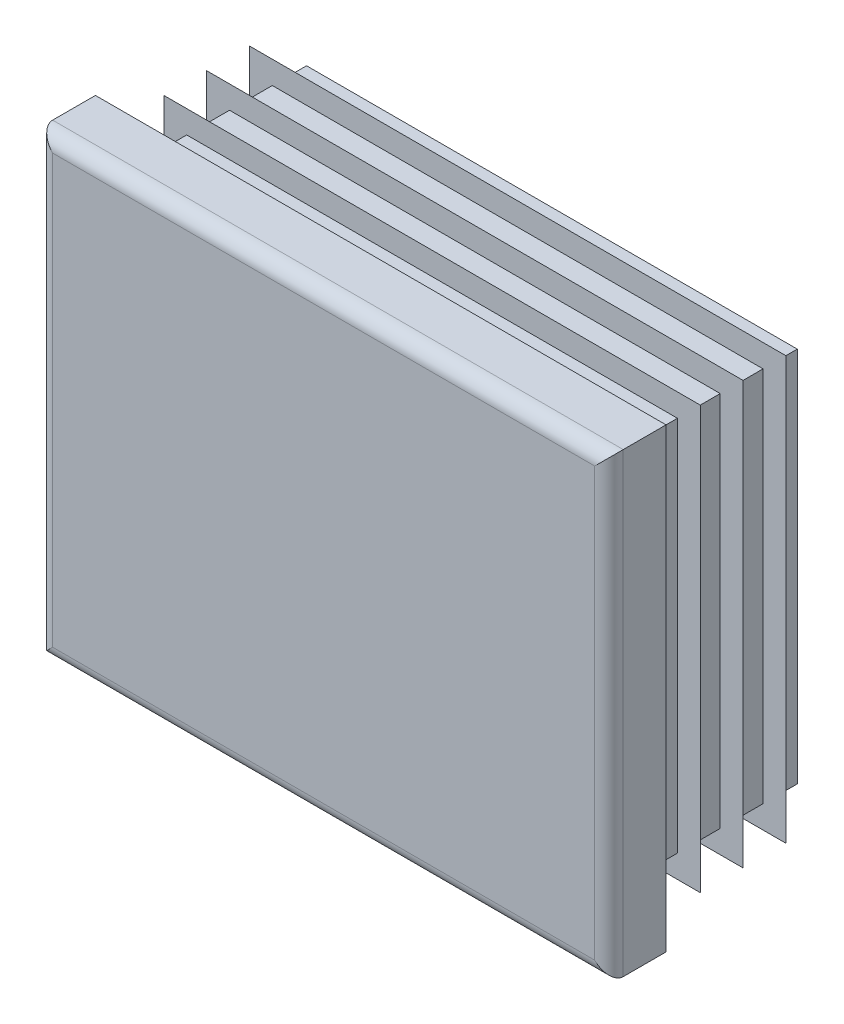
ISO-10303-21;
HEADER;
FILE_DESCRIPTION(('STEP AP214'),'2;1');
FILE_NAME('part.step','',(''),(''),'','','');
FILE_SCHEMA(('AUTOMOTIVE_DESIGN { 1 0 10303 214 1 1 1 1 }'));
ENDSEC;
DATA;
#1=APPLICATION_CONTEXT('core data for automotive mechanical design processes');
#2=APPLICATION_PROTOCOL_DEFINITION('international standard','automotive_design',2000,#1);
#3=PRODUCT_CONTEXT('',#1,'mechanical');
#4=PRODUCT('Part','Part','',(#3));
#5=PRODUCT_RELATED_PRODUCT_CATEGORY('part','',(#4));
#6=PRODUCT_DEFINITION_FORMATION('','',#4);
#7=PRODUCT_DEFINITION_CONTEXT('part definition',#1,'design');
#8=PRODUCT_DEFINITION('design','',#6,#7);
#9=PRODUCT_DEFINITION_SHAPE('','',#8);
#10=(LENGTH_UNIT() NAMED_UNIT(*) SI_UNIT(.MILLI.,.METRE.));
#11=(NAMED_UNIT(*) PLANE_ANGLE_UNIT() SI_UNIT($,.RADIAN.));
#12=(NAMED_UNIT(*) SI_UNIT($,.STERADIAN.) SOLID_ANGLE_UNIT());
#13=UNCERTAINTY_MEASURE_WITH_UNIT(LENGTH_MEASURE(1.E-05),#10,'distance_accuracy_value','');
#14=(GEOMETRIC_REPRESENTATION_CONTEXT(3) GLOBAL_UNCERTAINTY_ASSIGNED_CONTEXT((#13)) GLOBAL_UNIT_ASSIGNED_CONTEXT((#10,
#11,#12)) REPRESENTATION_CONTEXT('',''));
#15=CARTESIAN_POINT('',(0.,0.,0.));
#16=DIRECTION('',(0.,0.,1.));
#17=DIRECTION('',(1.,0.,0.));
#18=AXIS2_PLACEMENT_3D('',#15,#16,#17);
#19=CARTESIAN_POINT('',(23.75,-20.,5.));
#20=DIRECTION('',(0.,0.,-1.));
#21=DIRECTION('',(0.,1.,0.));
#22=AXIS2_PLACEMENT_3D('',#19,#20,#21);
#23=PLANE('',#22);
#24=DIRECTION('',(0.,1.,0.));
#25=VECTOR('',#24,1.);
#26=CARTESIAN_POINT('',(-23.75,-20.,5.));
#27=LINE('',#26,#25);
#28=CARTESIAN_POINT('',(-23.75,-18.75,5.));
#29=VERTEX_POINT('',#28);
#30=CARTESIAN_POINT('',(-23.75,18.75,5.));
#31=VERTEX_POINT('',#30);
#32=EDGE_CURVE('E310',#29,#31,#27,.T.);
#33=ORIENTED_EDGE('',*,*,#32,.F.);
#34=DIRECTION('',(-1.,0.,0.));
#35=VECTOR('',#34,1.);
#36=CARTESIAN_POINT('',(25.,-18.75,5.));
#37=LINE('',#36,#35);
#38=CARTESIAN_POINT('',(23.75,-18.75,5.));
#39=VERTEX_POINT('',#38);
#40=EDGE_CURVE('E482',#39,#29,#37,.T.);
#41=ORIENTED_EDGE('',*,*,#40,.F.);
#42=DIRECTION('',(0.,1.,0.));
#43=VECTOR('',#42,1.);
#44=CARTESIAN_POINT('',(23.75,-20.,5.));
#45=LINE('',#44,#43);
#46=CARTESIAN_POINT('',(23.75,18.75,5.));
#47=VERTEX_POINT('',#46);
#48=EDGE_CURVE('E305',#39,#47,#45,.T.);
#49=ORIENTED_EDGE('',*,*,#48,.T.);
#50=DIRECTION('',(-1.,0.,0.));
#51=VECTOR('',#50,1.);
#52=CARTESIAN_POINT('',(25.,18.75,5.));
#53=LINE('',#52,#51);
#54=EDGE_CURVE('E630',#47,#31,#53,.T.);
#55=ORIENTED_EDGE('',*,*,#54,.T.);
#56=EDGE_LOOP('',(#33,#41,#49,#55));
#57=FACE_BOUND('',#56,.T.);
#58=ADVANCED_FACE('F14',(#57),#23,.F.);
#59=CARTESIAN_POINT('',(-23.75,-20.,3.75));
#60=DIRECTION('',(0.,1.,0.));
#61=DIRECTION('',(-1.,0.,0.));
#62=AXIS2_PLACEMENT_3D('',#59,#60,#61);
#63=CYLINDRICAL_SURFACE('',#62,1.25);
#64=DIRECTION('',(0.,1.,0.));
#65=VECTOR('',#64,1.);
#66=CARTESIAN_POINT('',(-25.,-20.,3.75));
#67=LINE('',#66,#65);
#68=CARTESIAN_POINT('',(-25.,-20.,3.75));
#69=VERTEX_POINT('',#68);
#70=CARTESIAN_POINT('',(-25.,20.,3.75));
#71=VERTEX_POINT('',#70);
#72=EDGE_CURVE('E402',#69,#71,#67,.T.);
#73=ORIENTED_EDGE('',*,*,#72,.F.);
#74=CARTESIAN_POINT('',(-23.75,-18.75,3.75));
#75=DIRECTION('',(-0.707106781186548,0.707106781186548,0.));
#76=DIRECTION('',(0.707106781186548,0.707106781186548,0.));
#77=AXIS2_PLACEMENT_3D('',#74,#75,#76);
#78=ELLIPSE('',#77,1.76776695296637,1.25);
#79=EDGE_CURVE('E59',#69,#29,#78,.T.);
#80=ORIENTED_EDGE('',*,*,#79,.T.);
#81=ORIENTED_EDGE('',*,*,#32,.T.);
#82=CARTESIAN_POINT('',(-23.75,18.75,3.75));
#83=DIRECTION('',(0.707106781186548,0.707106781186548,0.));
#84=DIRECTION('',(-0.707106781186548,0.707106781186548,0.));
#85=AXIS2_PLACEMENT_3D('',#82,#83,#84);
#86=ELLIPSE('',#85,1.76776695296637,1.25);
#87=EDGE_CURVE('E306',#31,#71,#86,.F.);
#88=ORIENTED_EDGE('',*,*,#87,.T.);
#89=EDGE_LOOP('',(#73,#80,#81,#88));
#90=FACE_BOUND('',#89,.T.);
#91=ADVANCED_FACE('F16',(#90),#63,.T.);
#92=CARTESIAN_POINT('',(-25.,-20.,3.75));
#93=DIRECTION('',(1.,0.,0.));
#94=DIRECTION('',(0.,1.,0.));
#95=AXIS2_PLACEMENT_3D('',#92,#93,#94);
#96=PLANE('',#95);
#97=DIRECTION('',(0.,0.,-1.));
#98=VECTOR('',#97,1.);
#99=CARTESIAN_POINT('',(-25.,20.,3.75));
#100=LINE('',#99,#98);
#101=CARTESIAN_POINT('',(-25.,20.,0.));
#102=VERTEX_POINT('',#101);
#103=EDGE_CURVE('E615',#71,#102,#100,.T.);
#104=ORIENTED_EDGE('',*,*,#103,.T.);
#105=DIRECTION('',(0.,1.,0.));
#106=VECTOR('',#105,1.);
#107=CARTESIAN_POINT('',(-25.,-20.,0.));
#108=LINE('',#107,#106);
#109=CARTESIAN_POINT('',(-25.,-20.,0.));
#110=VERTEX_POINT('',#109);
#111=EDGE_CURVE('E400',#110,#102,#108,.T.);
#112=ORIENTED_EDGE('',*,*,#111,.F.);
#113=DIRECTION('',(0.,0.,-1.));
#114=VECTOR('',#113,1.);
#115=CARTESIAN_POINT('',(-25.,-20.,3.75));
#116=LINE('',#115,#114);
#117=EDGE_CURVE('E616',#69,#110,#116,.T.);
#118=ORIENTED_EDGE('',*,*,#117,.F.);
#119=ORIENTED_EDGE('',*,*,#72,.T.);
#120=EDGE_LOOP('',(#104,#112,#118,#119));
#121=FACE_BOUND('',#120,.T.);
#122=ADVANCED_FACE('F697',(#121),#96,.F.);
#123=CARTESIAN_POINT('',(-21.5,-20.,0.));
#124=DIRECTION('',(1.,0.,0.));
#125=DIRECTION('',(0.,1.,0.));
#126=AXIS2_PLACEMENT_3D('',#123,#124,#125);
#127=PLANE('',#126);
#128=DIRECTION('',(0.,1.,0.));
#129=VECTOR('',#128,1.);
#130=CARTESIAN_POINT('',(-21.5,-20.,0.));
#131=LINE('',#130,#129);
#132=CARTESIAN_POINT('',(-21.5,-16.5,0.));
#133=VERTEX_POINT('',#132);
#134=CARTESIAN_POINT('',(-21.5,16.5,0.));
#135=VERTEX_POINT('',#134);
#136=EDGE_CURVE('E397',#133,#135,#131,.T.);
#137=ORIENTED_EDGE('',*,*,#136,.T.);
#138=DIRECTION('',(0.,0.,-1.));
#139=VECTOR('',#138,1.);
#140=CARTESIAN_POINT('',(-21.5,16.5,0.));
#141=LINE('',#140,#139);
#142=CARTESIAN_POINT('',(-21.5,16.5,-0.75));
#143=VERTEX_POINT('',#142);
#144=EDGE_CURVE('E495',#135,#143,#141,.T.);
#145=ORIENTED_EDGE('',*,*,#144,.T.);
#146=DIRECTION('',(0.,1.,0.));
#147=VECTOR('',#146,1.);
#148=CARTESIAN_POINT('',(-21.5,-20.,-0.75));
#149=LINE('',#148,#147);
#150=CARTESIAN_POINT('',(-21.5,-16.5,-0.75));
#151=VERTEX_POINT('',#150);
#152=EDGE_CURVE('E394',#151,#143,#149,.T.);
#153=ORIENTED_EDGE('',*,*,#152,.F.);
#154=DIRECTION('',(0.,0.,1.));
#155=VECTOR('',#154,1.);
#156=CARTESIAN_POINT('',(-21.5,-16.5,0.));
#157=LINE('',#156,#155);
#158=EDGE_CURVE('E489',#151,#133,#157,.T.);
#159=ORIENTED_EDGE('',*,*,#158,.T.);
#160=EDGE_LOOP('',(#137,#145,#153,#159));
#161=FACE_BOUND('',#160,.T.);
#162=ADVANCED_FACE('F787',(#161),#127,.F.);
#163=CARTESIAN_POINT('',(-23.5,-20.,-0.75));
#164=DIRECTION('',(0.342020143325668,0.,0.939692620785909));
#165=DIRECTION('',(-0.939692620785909,0.,0.342020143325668));
#166=AXIS2_PLACEMENT_3D('',#163,#164,#165);
#167=PLANE('',#166);
#168=DIRECTION('',(0.,1.,0.));
#169=VECTOR('',#168,1.);
#170=CARTESIAN_POINT('',(-23.5,-20.,-0.75));
#171=LINE('',#170,#169);
#172=CARTESIAN_POINT('',(-23.5,-18.5,-0.75));
#173=VERTEX_POINT('',#172);
#174=CARTESIAN_POINT('',(-23.5,18.5,-0.75));
#175=VERTEX_POINT('',#174);
#176=EDGE_CURVE('E392',#173,#175,#171,.T.);
#177=ORIENTED_EDGE('',*,*,#176,.T.);
#178=DIRECTION('',(0.844349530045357,-0.43889572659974,-0.307318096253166));
#179=VECTOR('',#178,1.);
#180=CARTESIAN_POINT('',(-9.23261608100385,11.0837658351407,-5.94290306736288));
#181=LINE('',#180,#179);
#182=CARTESIAN_POINT('',(-21.5,17.4603932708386,-1.4779404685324));
#183=VERTEX_POINT('',#182);
#184=EDGE_CURVE('E519',#175,#183,#181,.T.);
#185=ORIENTED_EDGE('',*,*,#184,.T.);
#186=DIRECTION('',(0.,1.,0.));
#187=VECTOR('',#186,1.);
#188=CARTESIAN_POINT('',(-21.5,-20.,-1.4779404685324));
#189=LINE('',#188,#187);
#190=CARTESIAN_POINT('',(-21.5,-17.4603932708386,-1.4779404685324));
#191=VERTEX_POINT('',#190);
#192=EDGE_CURVE('E389',#191,#183,#189,.T.);
#193=ORIENTED_EDGE('',*,*,#192,.F.);
#194=DIRECTION('',(-0.844349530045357,-0.43889572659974,0.307318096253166));
#195=VECTOR('',#194,1.);
#196=CARTESIAN_POINT('',(-24.0558721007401,-18.7889441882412,-0.547679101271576));
#197=LINE('',#196,#195);
#198=EDGE_CURVE('E507',#191,#173,#197,.T.);
#199=ORIENTED_EDGE('',*,*,#198,.T.);
#200=EDGE_LOOP('',(#177,#185,#193,#199));
#201=FACE_BOUND('',#200,.T.);
#202=ADVANCED_FACE('F783',(#201),#167,.F.);
#203=CARTESIAN_POINT('',(-21.5,-20.,-1.4779404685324));
#204=DIRECTION('',(1.,0.,0.));
#205=DIRECTION('',(0.,1.,0.));
#206=AXIS2_PLACEMENT_3D('',#203,#204,#205);
#207=PLANE('',#206);
#208=ORIENTED_EDGE('',*,*,#192,.T.);
#209=DIRECTION('',(0.,-0.819152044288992,-0.573576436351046));
#210=VECTOR('',#209,1.);
#211=CARTESIAN_POINT('',(-21.5,-7.67590790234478,-19.078568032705));
#212=LINE('',#211,#210);
#213=CARTESIAN_POINT('',(-21.5,16.5,-2.15041507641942));
#214=VERTEX_POINT('',#213);
#215=EDGE_CURVE('E516',#183,#214,#212,.T.);
#216=ORIENTED_EDGE('',*,*,#215,.T.);
#217=DIRECTION('',(0.,0.,-1.));
#218=VECTOR('',#217,1.);
#219=CARTESIAN_POINT('',(-21.5,16.5,-1.4779404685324));
#220=LINE('',#219,#218);
#221=CARTESIAN_POINT('',(-21.5,16.5,-4.5));
#222=VERTEX_POINT('',#221);
#223=EDGE_CURVE('E525',#214,#222,#220,.T.);
#224=ORIENTED_EDGE('',*,*,#223,.T.);
#225=DIRECTION('',(0.,1.,0.));
#226=VECTOR('',#225,1.);
#227=CARTESIAN_POINT('',(-21.5,-20.,-4.5));
#228=LINE('',#227,#226);
#229=CARTESIAN_POINT('',(-21.5,-16.5,-4.5));
#230=VERTEX_POINT('',#229);
#231=EDGE_CURVE('E386',#230,#222,#228,.T.);
#232=ORIENTED_EDGE('',*,*,#231,.F.);
#233=DIRECTION('',(0.,0.,1.));
#234=VECTOR('',#233,1.);
#235=CARTESIAN_POINT('',(-21.5,-16.5,-1.4779404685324));
#236=LINE('',#235,#234);
#237=CARTESIAN_POINT('',(-21.5,-16.5,-2.15041507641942));
#238=VERTEX_POINT('',#237);
#239=EDGE_CURVE('E522',#230,#238,#236,.T.);
#240=ORIENTED_EDGE('',*,*,#239,.T.);
#241=DIRECTION('',(0.,-0.819152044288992,0.573576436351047));
#242=VECTOR('',#241,1.);
#243=CARTESIAN_POINT('',(-21.5,-19.1644949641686,-0.284715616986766));
#244=LINE('',#243,#242);
#245=EDGE_CURVE('E504',#238,#191,#244,.T.);
#246=ORIENTED_EDGE('',*,*,#245,.T.);
#247=EDGE_LOOP('',(#208,#216,#224,#232,#240,#246));
#248=FACE_BOUND('',#247,.T.);
#249=ADVANCED_FACE('F779',(#248),#207,.F.);
#250=CARTESIAN_POINT('',(-23.5,-20.,-4.5));
#251=DIRECTION('',(0.342020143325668,0.,0.939692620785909));
#252=DIRECTION('',(-0.939692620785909,0.,0.342020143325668));
#253=AXIS2_PLACEMENT_3D('',#250,#251,#252);
#254=PLANE('',#253);
#255=DIRECTION('',(0.,1.,0.));
#256=VECTOR('',#255,1.);
#257=CARTESIAN_POINT('',(-23.5,-20.,-4.5));
#258=LINE('',#257,#256);
#259=CARTESIAN_POINT('',(-23.5,-18.5,-4.5));
#260=VERTEX_POINT('',#259);
#261=CARTESIAN_POINT('',(-23.5,18.5,-4.5));
#262=VERTEX_POINT('',#261);
#263=EDGE_CURVE('E384',#260,#262,#258,.T.);
#264=ORIENTED_EDGE('',*,*,#263,.T.);
#265=DIRECTION('',(0.844349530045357,-0.43889572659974,-0.307318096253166));
#266=VECTOR('',#265,1.);
#267=CARTESIAN_POINT('',(-9.23261608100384,11.0837658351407,-9.69290306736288));
#268=LINE('',#267,#266);
#269=CARTESIAN_POINT('',(-21.5,17.4603932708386,-5.2279404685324));
#270=VERTEX_POINT('',#269);
#271=EDGE_CURVE('E549',#262,#270,#268,.T.);
#272=ORIENTED_EDGE('',*,*,#271,.T.);
#273=DIRECTION('',(0.,1.,0.));
#274=VECTOR('',#273,1.);
#275=CARTESIAN_POINT('',(-21.5,-20.,-5.2279404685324));
#276=LINE('',#275,#274);
#277=CARTESIAN_POINT('',(-21.5,-17.4603932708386,-5.2279404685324));
#278=VERTEX_POINT('',#277);
#279=EDGE_CURVE('E381',#278,#270,#276,.T.);
#280=ORIENTED_EDGE('',*,*,#279,.F.);
#281=DIRECTION('',(-0.844349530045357,-0.43889572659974,0.307318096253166));
#282=VECTOR('',#281,1.);
#283=CARTESIAN_POINT('',(-24.0558721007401,-18.7889441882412,-4.29767910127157));
#284=LINE('',#283,#282);
#285=EDGE_CURVE('E537',#278,#260,#284,.T.);
#286=ORIENTED_EDGE('',*,*,#285,.T.);
#287=EDGE_LOOP('',(#264,#272,#280,#286));
#288=FACE_BOUND('',#287,.T.);
#289=ADVANCED_FACE('F775',(#288),#254,.F.);
#290=CARTESIAN_POINT('',(-21.5,-20.,-5.2279404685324));
#291=DIRECTION('',(1.,0.,0.));
#292=DIRECTION('',(0.,1.,0.));
#293=AXIS2_PLACEMENT_3D('',#290,#291,#292);
#294=PLANE('',#293);
#295=ORIENTED_EDGE('',*,*,#279,.T.);
#296=DIRECTION('',(0.,-0.819152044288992,-0.573576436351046));
#297=VECTOR('',#296,1.);
#298=CARTESIAN_POINT('',(-21.5,-7.67590790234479,-22.828568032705));
#299=LINE('',#298,#297);
#300=CARTESIAN_POINT('',(-21.5,16.5,-5.90041507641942));
#301=VERTEX_POINT('',#300);
#302=EDGE_CURVE('E546',#270,#301,#299,.T.);
#303=ORIENTED_EDGE('',*,*,#302,.T.);
#304=DIRECTION('',(0.,0.,-1.));
#305=VECTOR('',#304,1.);
#306=CARTESIAN_POINT('',(-21.5,16.5,-5.2279404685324));
#307=LINE('',#306,#305);
#308=CARTESIAN_POINT('',(-21.5,16.5,-8.25));
#309=VERTEX_POINT('',#308);
#310=EDGE_CURVE('E555',#301,#309,#307,.T.);
#311=ORIENTED_EDGE('',*,*,#310,.T.);
#312=DIRECTION('',(0.,1.,0.));
#313=VECTOR('',#312,1.);
#314=CARTESIAN_POINT('',(-21.5,-20.,-8.25));
#315=LINE('',#314,#313);
#316=CARTESIAN_POINT('',(-21.5,-16.5,-8.25));
#317=VERTEX_POINT('',#316);
#318=EDGE_CURVE('E378',#317,#309,#315,.T.);
#319=ORIENTED_EDGE('',*,*,#318,.F.);
#320=DIRECTION('',(0.,0.,1.));
#321=VECTOR('',#320,1.);
#322=CARTESIAN_POINT('',(-21.5,-16.5,-5.2279404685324));
#323=LINE('',#322,#321);
#324=CARTESIAN_POINT('',(-21.5,-16.5,-5.90041507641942));
#325=VERTEX_POINT('',#324);
#326=EDGE_CURVE('E552',#317,#325,#323,.T.);
#327=ORIENTED_EDGE('',*,*,#326,.T.);
#328=DIRECTION('',(0.,-0.819152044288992,0.573576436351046));
#329=VECTOR('',#328,1.);
#330=CARTESIAN_POINT('',(-21.5,-19.1644949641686,-4.03471561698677));
#331=LINE('',#330,#329);
#332=EDGE_CURVE('E534',#325,#278,#331,.T.);
#333=ORIENTED_EDGE('',*,*,#332,.T.);
#334=EDGE_LOOP('',(#295,#303,#311,#319,#327,#333));
#335=FACE_BOUND('',#334,.T.);
#336=ADVANCED_FACE('F771',(#335),#294,.F.);
#337=CARTESIAN_POINT('',(-23.5,-20.,-8.25));
#338=DIRECTION('',(0.342020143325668,0.,0.939692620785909));
#339=DIRECTION('',(-0.939692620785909,0.,0.342020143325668));
#340=AXIS2_PLACEMENT_3D('',#337,#338,#339);
#341=PLANE('',#340);
#342=DIRECTION('',(0.,1.,0.));
#343=VECTOR('',#342,1.);
#344=CARTESIAN_POINT('',(-23.5,-20.,-8.25));
#345=LINE('',#344,#343);
#346=CARTESIAN_POINT('',(-23.5,-18.5,-8.25));
#347=VERTEX_POINT('',#346);
#348=CARTESIAN_POINT('',(-23.5,18.5,-8.25));
#349=VERTEX_POINT('',#348);
#350=EDGE_CURVE('E376',#347,#349,#345,.T.);
#351=ORIENTED_EDGE('',*,*,#350,.T.);
#352=DIRECTION('',(0.844349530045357,-0.438895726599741,-0.307318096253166));
#353=VECTOR('',#352,1.);
#354=CARTESIAN_POINT('',(-9.23261608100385,11.0837658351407,-13.4429030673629));
#355=LINE('',#354,#353);
#356=CARTESIAN_POINT('',(-21.5,17.4603932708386,-8.97794046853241));
#357=VERTEX_POINT('',#356);
#358=EDGE_CURVE('E579',#349,#357,#355,.T.);
#359=ORIENTED_EDGE('',*,*,#358,.T.);
#360=DIRECTION('',(0.,1.,0.));
#361=VECTOR('',#360,1.);
#362=CARTESIAN_POINT('',(-21.5,-20.,-8.9779404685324));
#363=LINE('',#362,#361);
#364=CARTESIAN_POINT('',(-21.5,-17.4603932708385,-8.9779404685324));
#365=VERTEX_POINT('',#364);
#366=EDGE_CURVE('E373',#365,#357,#363,.T.);
#367=ORIENTED_EDGE('',*,*,#366,.F.);
#368=DIRECTION('',(-0.844349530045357,-0.438895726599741,0.307318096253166));
#369=VECTOR('',#368,1.);
#370=CARTESIAN_POINT('',(-24.0558721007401,-18.7889441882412,-8.04767910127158));
#371=LINE('',#370,#369);
#372=EDGE_CURVE('E567',#365,#347,#371,.T.);
#373=ORIENTED_EDGE('',*,*,#372,.T.);
#374=EDGE_LOOP('',(#351,#359,#367,#373));
#375=FACE_BOUND('',#374,.T.);
#376=ADVANCED_FACE('F767',(#375),#341,.F.);
#377=CARTESIAN_POINT('',(-21.5,-20.,-8.9779404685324));
#378=DIRECTION('',(1.,0.,0.));
#379=DIRECTION('',(0.,1.,0.));
#380=AXIS2_PLACEMENT_3D('',#377,#378,#379);
#381=PLANE('',#380);
#382=ORIENTED_EDGE('',*,*,#366,.T.);
#383=DIRECTION('',(0.,-0.819152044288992,-0.573576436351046));
#384=VECTOR('',#383,1.);
#385=CARTESIAN_POINT('',(-21.5,-7.6759079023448,-26.578568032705));
#386=LINE('',#385,#384);
#387=CARTESIAN_POINT('',(-21.5,16.5,-9.65041507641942));
#388=VERTEX_POINT('',#387);
#389=EDGE_CURVE('E576',#357,#388,#386,.T.);
#390=ORIENTED_EDGE('',*,*,#389,.T.);
#391=DIRECTION('',(0.,0.,-1.));
#392=VECTOR('',#391,1.);
#393=CARTESIAN_POINT('',(-21.5,16.5,-8.9779404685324));
#394=LINE('',#393,#392);
#395=CARTESIAN_POINT('',(-21.5,16.5,-12.));
#396=VERTEX_POINT('',#395);
#397=EDGE_CURVE('E585',#388,#396,#394,.T.);
#398=ORIENTED_EDGE('',*,*,#397,.T.);
#399=DIRECTION('',(0.,1.,0.));
#400=VECTOR('',#399,1.);
#401=CARTESIAN_POINT('',(-21.5,-20.,-12.));
#402=LINE('',#401,#400);
#403=CARTESIAN_POINT('',(-21.5,-16.5,-12.));
#404=VERTEX_POINT('',#403);
#405=EDGE_CURVE('E370',#404,#396,#402,.T.);
#406=ORIENTED_EDGE('',*,*,#405,.F.);
#407=DIRECTION('',(0.,0.,1.));
#408=VECTOR('',#407,1.);
#409=CARTESIAN_POINT('',(-21.5,-16.5,-8.9779404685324));
#410=LINE('',#409,#408);
#411=CARTESIAN_POINT('',(-21.5,-16.5,-9.65041507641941));
#412=VERTEX_POINT('',#411);
#413=EDGE_CURVE('E582',#404,#412,#410,.T.);
#414=ORIENTED_EDGE('',*,*,#413,.T.);
#415=DIRECTION('',(0.,-0.819152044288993,0.573576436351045));
#416=VECTOR('',#415,1.);
#417=CARTESIAN_POINT('',(-21.5,-19.1644949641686,-7.78471561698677));
#418=LINE('',#417,#416);
#419=EDGE_CURVE('E564',#412,#365,#418,.T.);
#420=ORIENTED_EDGE('',*,*,#419,.T.);
#421=EDGE_LOOP('',(#382,#390,#398,#406,#414,#420));
#422=FACE_BOUND('',#421,.T.);
#423=ADVANCED_FACE('F764',(#422),#381,.F.);
#424=CARTESIAN_POINT('',(-23.5,-20.,-12.));
#425=DIRECTION('',(0.342020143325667,0.,0.939692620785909));
#426=DIRECTION('',(-0.939692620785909,0.,0.342020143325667));
#427=AXIS2_PLACEMENT_3D('',#424,#425,#426);
#428=PLANE('',#427);
#429=DIRECTION('',(0.,1.,0.));
#430=VECTOR('',#429,1.);
#431=CARTESIAN_POINT('',(-23.5,-20.,-12.));
#432=LINE('',#431,#430);
#433=CARTESIAN_POINT('',(-23.5,-18.5,-12.));
#434=VERTEX_POINT('',#433);
#435=CARTESIAN_POINT('',(-23.5,18.5,-12.));
#436=VERTEX_POINT('',#435);
#437=EDGE_CURVE('E368',#434,#436,#432,.T.);
#438=ORIENTED_EDGE('',*,*,#437,.T.);
#439=DIRECTION('',(0.844349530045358,-0.438895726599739,-0.307318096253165));
#440=VECTOR('',#439,1.);
#441=CARTESIAN_POINT('',(-9.23261608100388,11.0837658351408,-17.1929030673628));
#442=LINE('',#441,#440);
#443=CARTESIAN_POINT('',(-21.5,17.4603932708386,-12.7279404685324));
#444=VERTEX_POINT('',#443);
#445=EDGE_CURVE('E607',#436,#444,#442,.T.);
#446=ORIENTED_EDGE('',*,*,#445,.T.);
#447=DIRECTION('',(0.,1.,0.));
#448=VECTOR('',#447,1.);
#449=CARTESIAN_POINT('',(-21.5,-20.,-12.7279404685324));
#450=LINE('',#449,#448);
#451=CARTESIAN_POINT('',(-21.5,-17.4603932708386,-12.7279404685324));
#452=VERTEX_POINT('',#451);
#453=EDGE_CURVE('E365',#452,#444,#450,.T.);
#454=ORIENTED_EDGE('',*,*,#453,.F.);
#455=DIRECTION('',(-0.844349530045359,-0.438895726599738,0.307318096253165));
#456=VECTOR('',#455,1.);
#457=CARTESIAN_POINT('',(-24.0558721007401,-18.7889441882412,-11.7976791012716));
#458=LINE('',#457,#456);
#459=EDGE_CURVE('E595',#452,#434,#458,.T.);
#460=ORIENTED_EDGE('',*,*,#459,.T.);
#461=EDGE_LOOP('',(#438,#446,#454,#460));
#462=FACE_BOUND('',#461,.T.);
#463=ADVANCED_FACE('F675',(#462),#428,.F.);
#464=CARTESIAN_POINT('',(-21.5,-20.,-12.7279404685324));
#465=DIRECTION('',(1.,0.,0.));
#466=DIRECTION('',(0.,1.,0.));
#467=AXIS2_PLACEMENT_3D('',#464,#465,#466);
#468=PLANE('',#467);
#469=ORIENTED_EDGE('',*,*,#453,.T.);
#470=DIRECTION('',(0.,-0.819152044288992,-0.573576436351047));
#471=VECTOR('',#470,1.);
#472=CARTESIAN_POINT('',(-21.5,-7.67590790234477,-30.328568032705));
#473=LINE('',#472,#471);
#474=CARTESIAN_POINT('',(-21.5,16.5,-13.4004150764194));
#475=VERTEX_POINT('',#474);
#476=EDGE_CURVE('E604',#444,#475,#473,.T.);
#477=ORIENTED_EDGE('',*,*,#476,.T.);
#478=DIRECTION('',(0.,0.,-1.));
#479=VECTOR('',#478,1.);
#480=CARTESIAN_POINT('',(-21.5,16.5,-12.7279404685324));
#481=LINE('',#480,#479);
#482=CARTESIAN_POINT('',(-21.5,16.5,-15.));
#483=VERTEX_POINT('',#482);
#484=EDGE_CURVE('E613',#475,#483,#481,.T.);
#485=ORIENTED_EDGE('',*,*,#484,.T.);
#486=DIRECTION('',(0.,1.,0.));
#487=VECTOR('',#486,1.);
#488=CARTESIAN_POINT('',(-21.5,-20.,-15.));
#489=LINE('',#488,#487);
#490=CARTESIAN_POINT('',(-21.5,-16.5,-15.));
#491=VERTEX_POINT('',#490);
#492=EDGE_CURVE('E362',#491,#483,#489,.T.);
#493=ORIENTED_EDGE('',*,*,#492,.F.);
#494=DIRECTION('',(0.,0.,1.));
#495=VECTOR('',#494,1.);
#496=CARTESIAN_POINT('',(-21.5,-16.5,-12.7279404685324));
#497=LINE('',#496,#495);
#498=CARTESIAN_POINT('',(-21.5,-16.5,-13.4004150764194));
#499=VERTEX_POINT('',#498);
#500=EDGE_CURVE('E610',#491,#499,#497,.T.);
#501=ORIENTED_EDGE('',*,*,#500,.T.);
#502=DIRECTION('',(0.,-0.819152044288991,0.573576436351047));
#503=VECTOR('',#502,1.);
#504=CARTESIAN_POINT('',(-21.5,-19.1644949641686,-11.5347156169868));
#505=LINE('',#504,#503);
#506=EDGE_CURVE('E592',#499,#452,#505,.T.);
#507=ORIENTED_EDGE('',*,*,#506,.T.);
#508=EDGE_LOOP('',(#469,#477,#485,#493,#501,#507));
#509=FACE_BOUND('',#508,.T.);
#510=ADVANCED_FACE('F677',(#509),#468,.F.);
#511=CARTESIAN_POINT('',(-21.5,-20.,-15.));
#512=DIRECTION('',(0.,0.,1.));
#513=DIRECTION('',(0.,-1.,0.));
#514=AXIS2_PLACEMENT_3D('',#511,#512,#513);
#515=PLANE('',#514);
#516=ORIENTED_EDGE('',*,*,#492,.T.);
#517=DIRECTION('',(-1.,0.,0.));
#518=VECTOR('',#517,1.);
#519=CARTESIAN_POINT('',(25.,16.5,-15.));
#520=LINE('',#519,#518);
#521=CARTESIAN_POINT('',(21.5,16.5,-15.));
#522=VERTEX_POINT('',#521);
#523=EDGE_CURVE('E438',#522,#483,#520,.T.);
#524=ORIENTED_EDGE('',*,*,#523,.F.);
#525=DIRECTION('',(0.,1.,0.));
#526=VECTOR('',#525,1.);
#527=CARTESIAN_POINT('',(21.5,-20.,-15.));
#528=LINE('',#527,#526);
#529=CARTESIAN_POINT('',(21.5,-16.5,-15.));
#530=VERTEX_POINT('',#529);
#531=EDGE_CURVE('E359',#530,#522,#528,.T.);
#532=ORIENTED_EDGE('',*,*,#531,.F.);
#533=DIRECTION('',(-1.,0.,0.));
#534=VECTOR('',#533,1.);
#535=CARTESIAN_POINT('',(25.,-16.5,-15.));
#536=LINE('',#535,#534);
#537=EDGE_CURVE('E436',#530,#491,#536,.T.);
#538=ORIENTED_EDGE('',*,*,#537,.T.);
#539=EDGE_LOOP('',(#516,#524,#532,#538));
#540=FACE_BOUND('',#539,.T.);
#541=ADVANCED_FACE('F435',(#540),#515,.F.);
#542=CARTESIAN_POINT('',(21.5,-20.,-15.));
#543=DIRECTION('',(-1.,0.,0.));
#544=DIRECTION('',(0.,-1.,0.));
#545=AXIS2_PLACEMENT_3D('',#542,#543,#544);
#546=PLANE('',#545);
#547=DIRECTION('',(0.,0.,1.));
#548=VECTOR('',#547,1.);
#549=CARTESIAN_POINT('',(21.5,16.5,-15.));
#550=LINE('',#549,#548);
#551=CARTESIAN_POINT('',(21.5,16.5,-13.4004150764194));
#552=VERTEX_POINT('',#551);
#553=EDGE_CURVE('E9',#522,#552,#550,.T.);
#554=ORIENTED_EDGE('',*,*,#553,.T.);
#555=DIRECTION('',(0.,0.819152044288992,0.573576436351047));
#556=VECTOR('',#555,1.);
#557=CARTESIAN_POINT('',(21.5,-8.74342669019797,-31.0760527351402));
#558=LINE('',#557,#556);
#559=CARTESIAN_POINT('',(21.5,17.4603932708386,-12.7279404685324));
#560=VERTEX_POINT('',#559);
#561=EDGE_CURVE('E601',#552,#560,#558,.T.);
#562=ORIENTED_EDGE('',*,*,#561,.T.);
#563=DIRECTION('',(0.,1.,0.));
#564=VECTOR('',#563,1.);
#565=CARTESIAN_POINT('',(21.5,-20.,-12.7279404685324));
#566=LINE('',#565,#564);
#567=CARTESIAN_POINT('',(21.5,-17.4603932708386,-12.7279404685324));
#568=VERTEX_POINT('',#567);
#569=EDGE_CURVE('E356',#568,#560,#566,.T.);
#570=ORIENTED_EDGE('',*,*,#569,.F.);
#571=DIRECTION('',(0.,0.819152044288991,-0.573576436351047));
#572=VECTOR('',#571,1.);
#573=CARTESIAN_POINT('',(21.5,-18.0969761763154,-12.2822003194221));
#574=LINE('',#573,#572);
#575=CARTESIAN_POINT('',(21.5,-16.5,-13.4004150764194));
#576=VERTEX_POINT('',#575);
#577=EDGE_CURVE('E428',#568,#576,#574,.T.);
#578=ORIENTED_EDGE('',*,*,#577,.T.);
#579=DIRECTION('',(0.,0.,-1.));
#580=VECTOR('',#579,1.);
#581=CARTESIAN_POINT('',(21.5,-16.5,-15.));
#582=LINE('',#581,#580);
#583=EDGE_CURVE('E23',#576,#530,#582,.T.);
#584=ORIENTED_EDGE('',*,*,#583,.T.);
#585=ORIENTED_EDGE('',*,*,#531,.T.);
#586=EDGE_LOOP('',(#554,#562,#570,#578,#584,#585));
#587=FACE_BOUND('',#586,.T.);
#588=ADVANCED_FACE('F426',(#587),#546,.F.);
#589=CARTESIAN_POINT('',(21.5,-20.,-12.7279404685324));
#590=DIRECTION('',(-0.342020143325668,0.,0.939692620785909));
#591=DIRECTION('',(-0.939692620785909,0.,-0.342020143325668));
#592=AXIS2_PLACEMENT_3D('',#589,#590,#591);
#593=PLANE('',#592);
#594=ORIENTED_EDGE('',*,*,#569,.T.);
#595=DIRECTION('',(0.844349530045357,0.43889572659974,0.307318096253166));
#596=VECTOR('',#595,1.);
#597=CARTESIAN_POINT('',(7.61787499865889,10.244417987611,-17.7806207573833));
#598=LINE('',#597,#596);
#599=CARTESIAN_POINT('',(23.5,18.5,-12.));
#600=VERTEX_POINT('',#599);
#601=EDGE_CURVE('E598',#560,#600,#598,.T.);
#602=ORIENTED_EDGE('',*,*,#601,.T.);
#603=DIRECTION('',(0.,1.,0.));
#604=VECTOR('',#603,1.);
#605=CARTESIAN_POINT('',(23.5,-20.,-12.));
#606=LINE('',#605,#604);
#607=CARTESIAN_POINT('',(23.5,-18.5,-12.));
#608=VERTEX_POINT('',#607);
#609=EDGE_CURVE('E353',#608,#600,#606,.T.);
#610=ORIENTED_EDGE('',*,*,#609,.F.);
#611=DIRECTION('',(-0.844349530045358,0.438895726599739,-0.307318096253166));
#612=VECTOR('',#611,1.);
#613=CARTESIAN_POINT('',(22.4411310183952,-17.9495963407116,-12.3853967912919));
#614=LINE('',#613,#612);
#615=EDGE_CURVE('E588',#608,#568,#614,.T.);
#616=ORIENTED_EDGE('',*,*,#615,.T.);
#617=EDGE_LOOP('',(#594,#602,#610,#616));
#618=FACE_BOUND('',#617,.T.);
#619=ADVANCED_FACE('F752',(#618),#593,.F.);
#620=CARTESIAN_POINT('',(23.5,-20.,-12.));
#621=DIRECTION('',(0.,0.,-1.));
#622=DIRECTION('',(0.,1.,0.));
#623=AXIS2_PLACEMENT_3D('',#620,#621,#622);
#624=PLANE('',#623);
#625=ORIENTED_EDGE('',*,*,#609,.T.);
#626=DIRECTION('',(-1.,0.,0.));
#627=VECTOR('',#626,1.);
#628=CARTESIAN_POINT('',(25.,18.5,-12.));
#629=LINE('',#628,#627);
#630=EDGE_CURVE('E444',#600,#436,#629,.T.);
#631=ORIENTED_EDGE('',*,*,#630,.T.);
#632=ORIENTED_EDGE('',*,*,#437,.F.);
#633=DIRECTION('',(-1.,0.,0.));
#634=VECTOR('',#633,1.);
#635=CARTESIAN_POINT('',(25.,-18.5,-12.));
#636=LINE('',#635,#634);
#637=EDGE_CURVE('E451',#608,#434,#636,.T.);
#638=ORIENTED_EDGE('',*,*,#637,.F.);
#639=EDGE_LOOP('',(#625,#631,#632,#638));
#640=FACE_BOUND('',#639,.T.);
#641=ORIENTED_EDGE('',*,*,#405,.T.);
#642=DIRECTION('',(-1.,0.,0.));
#643=VECTOR('',#642,1.);
#644=CARTESIAN_POINT('',(25.,16.5,-12.));
#645=LINE('',#644,#643);
#646=CARTESIAN_POINT('',(21.5,16.5,-12.));
#647=VERTEX_POINT('',#646);
#648=EDGE_CURVE('E663',#647,#396,#645,.T.);
#649=ORIENTED_EDGE('',*,*,#648,.F.);
#650=DIRECTION('',(0.,1.,0.));
#651=VECTOR('',#650,1.);
#652=CARTESIAN_POINT('',(21.5,-20.,-12.));
#653=LINE('',#652,#651);
#654=CARTESIAN_POINT('',(21.5,-16.5,-12.));
#655=VERTEX_POINT('',#654);
#656=EDGE_CURVE('E350',#655,#647,#653,.T.);
#657=ORIENTED_EDGE('',*,*,#656,.F.);
#658=DIRECTION('',(-1.,0.,0.));
#659=VECTOR('',#658,1.);
#660=CARTESIAN_POINT('',(25.,-16.5,-12.));
#661=LINE('',#660,#659);
#662=EDGE_CURVE('E453',#655,#404,#661,.T.);
#663=ORIENTED_EDGE('',*,*,#662,.T.);
#664=EDGE_LOOP('',(#641,#649,#657,#663));
#665=FACE_BOUND('',#664,.T.);
#666=ADVANCED_FACE('F667',(#640,#665),#624,.F.);
#667=CARTESIAN_POINT('',(21.5,-20.,-12.));
#668=DIRECTION('',(-1.,0.,0.));
#669=DIRECTION('',(0.,-1.,0.));
#670=AXIS2_PLACEMENT_3D('',#667,#668,#669);
#671=PLANE('',#670);
#672=DIRECTION('',(0.,0.,1.));
#673=VECTOR('',#672,1.);
#674=CARTESIAN_POINT('',(21.5,16.5,-12.));
#675=LINE('',#674,#673);
#676=CARTESIAN_POINT('',(21.5,16.5,-9.65041507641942));
#677=VERTEX_POINT('',#676);
#678=EDGE_CURVE('E420',#647,#677,#675,.T.);
#679=ORIENTED_EDGE('',*,*,#678,.T.);
#680=DIRECTION('',(0.,0.819152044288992,0.573576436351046));
#681=VECTOR('',#680,1.);
#682=CARTESIAN_POINT('',(21.5,-9.09581142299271,-27.5727951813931));
#683=LINE('',#682,#681);
#684=CARTESIAN_POINT('',(21.5,17.4603932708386,-8.9779404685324));
#685=VERTEX_POINT('',#684);
#686=EDGE_CURVE('E573',#677,#685,#683,.T.);
#687=ORIENTED_EDGE('',*,*,#686,.T.);
#688=DIRECTION('',(0.,1.,0.));
#689=VECTOR('',#688,1.);
#690=CARTESIAN_POINT('',(21.5,-20.,-8.9779404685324));
#691=LINE('',#690,#689);
#692=CARTESIAN_POINT('',(21.5,-17.4603932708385,-8.9779404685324));
#693=VERTEX_POINT('',#692);
#694=EDGE_CURVE('E347',#693,#685,#691,.T.);
#695=ORIENTED_EDGE('',*,*,#694,.F.);
#696=DIRECTION('',(0.,0.819152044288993,-0.573576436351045));
#697=VECTOR('',#696,1.);
#698=CARTESIAN_POINT('',(21.5,-17.7445914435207,-8.77894276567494));
#699=LINE('',#698,#697);
#700=CARTESIAN_POINT('',(21.5,-16.5,-9.65041507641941));
#701=VERTEX_POINT('',#700);
#702=EDGE_CURVE('E561',#693,#701,#699,.T.);
#703=ORIENTED_EDGE('',*,*,#702,.T.);
#704=DIRECTION('',(0.,0.,-1.));
#705=VECTOR('',#704,1.);
#706=CARTESIAN_POINT('',(21.5,-16.5,-12.));
#707=LINE('',#706,#705);
#708=EDGE_CURVE('E417',#701,#655,#707,.T.);
#709=ORIENTED_EDGE('',*,*,#708,.T.);
#710=ORIENTED_EDGE('',*,*,#656,.T.);
#711=EDGE_LOOP('',(#679,#687,#695,#703,#709,#710));
#712=FACE_BOUND('',#711,.T.);
#713=ADVANCED_FACE('F745',(#712),#671,.F.);
#714=CARTESIAN_POINT('',(21.5,-20.,-8.9779404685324));
#715=DIRECTION('',(-0.342020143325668,0.,0.939692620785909));
#716=DIRECTION('',(-0.939692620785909,0.,-0.342020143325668));
#717=AXIS2_PLACEMENT_3D('',#714,#715,#716);
#718=PLANE('',#717);
#719=ORIENTED_EDGE('',*,*,#694,.T.);
#720=DIRECTION('',(0.844349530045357,0.438895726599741,0.307318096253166));
#721=VECTOR('',#720,1.);
#722=CARTESIAN_POINT('',(7.61787499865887,10.244417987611,-14.0306207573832));
#723=LINE('',#722,#721);
#724=CARTESIAN_POINT('',(23.5,18.5,-8.25));
#725=VERTEX_POINT('',#724);
#726=EDGE_CURVE('E570',#685,#725,#723,.T.);
#727=ORIENTED_EDGE('',*,*,#726,.T.);
#728=DIRECTION('',(0.,1.,0.));
#729=VECTOR('',#728,1.);
#730=CARTESIAN_POINT('',(23.5,-20.,-8.25));
#731=LINE('',#730,#729);
#732=CARTESIAN_POINT('',(23.5,-18.5,-8.25));
#733=VERTEX_POINT('',#732);
#734=EDGE_CURVE('E344',#733,#725,#731,.T.);
#735=ORIENTED_EDGE('',*,*,#734,.F.);
#736=DIRECTION('',(-0.844349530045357,0.438895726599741,-0.307318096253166));
#737=VECTOR('',#736,1.);
#738=CARTESIAN_POINT('',(22.4411310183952,-17.9495963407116,-8.63539679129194));
#739=LINE('',#738,#737);
#740=EDGE_CURVE('E558',#733,#693,#739,.T.);
#741=ORIENTED_EDGE('',*,*,#740,.T.);
#742=EDGE_LOOP('',(#719,#727,#735,#741));
#743=FACE_BOUND('',#742,.T.);
#744=ADVANCED_FACE('F741',(#743),#718,.F.);
#745=CARTESIAN_POINT('',(23.5,-20.,-8.25));
#746=DIRECTION('',(0.,0.,-1.));
#747=DIRECTION('',(0.,1.,0.));
#748=AXIS2_PLACEMENT_3D('',#745,#746,#747);
#749=PLANE('',#748);
#750=ORIENTED_EDGE('',*,*,#734,.T.);
#751=DIRECTION('',(-1.,0.,0.));
#752=VECTOR('',#751,1.);
#753=CARTESIAN_POINT('',(25.,18.5,-8.25));
#754=LINE('',#753,#752);
#755=EDGE_CURVE('E657',#725,#349,#754,.T.);
#756=ORIENTED_EDGE('',*,*,#755,.T.);
#757=ORIENTED_EDGE('',*,*,#350,.F.);
#758=DIRECTION('',(-1.,0.,0.));
#759=VECTOR('',#758,1.);
#760=CARTESIAN_POINT('',(25.,-18.5,-8.25));
#761=LINE('',#760,#759);
#762=EDGE_CURVE('E459',#733,#347,#761,.T.);
#763=ORIENTED_EDGE('',*,*,#762,.F.);
#764=EDGE_LOOP('',(#750,#756,#757,#763));
#765=FACE_BOUND('',#764,.T.);
#766=ORIENTED_EDGE('',*,*,#318,.T.);
#767=DIRECTION('',(-1.,0.,0.));
#768=VECTOR('',#767,1.);
#769=CARTESIAN_POINT('',(25.,16.5,-8.25));
#770=LINE('',#769,#768);
#771=CARTESIAN_POINT('',(21.5,16.5,-8.25));
#772=VERTEX_POINT('',#771);
#773=EDGE_CURVE('E655',#772,#309,#770,.T.);
#774=ORIENTED_EDGE('',*,*,#773,.F.);
#775=DIRECTION('',(0.,1.,0.));
#776=VECTOR('',#775,1.);
#777=CARTESIAN_POINT('',(21.5,-20.,-8.25));
#778=LINE('',#777,#776);
#779=CARTESIAN_POINT('',(21.5,-16.5,-8.25));
#780=VERTEX_POINT('',#779);
#781=EDGE_CURVE('E341',#780,#772,#778,.T.);
#782=ORIENTED_EDGE('',*,*,#781,.F.);
#783=DIRECTION('',(-1.,0.,0.));
#784=VECTOR('',#783,1.);
#785=CARTESIAN_POINT('',(25.,-16.5,-8.25));
#786=LINE('',#785,#784);
#787=EDGE_CURVE('E461',#780,#317,#786,.T.);
#788=ORIENTED_EDGE('',*,*,#787,.T.);
#789=EDGE_LOOP('',(#766,#774,#782,#788));
#790=FACE_BOUND('',#789,.T.);
#791=ADVANCED_FACE('F737',(#765,#790),#749,.F.);
#792=CARTESIAN_POINT('',(21.5,-20.,-8.25));
#793=DIRECTION('',(-1.,0.,0.));
#794=DIRECTION('',(0.,-1.,0.));
#795=AXIS2_PLACEMENT_3D('',#792,#793,#794);
#796=PLANE('',#795);
#797=DIRECTION('',(0.,0.,1.));
#798=VECTOR('',#797,1.);
#799=CARTESIAN_POINT('',(21.5,16.5,-8.25));
#800=LINE('',#799,#798);
#801=CARTESIAN_POINT('',(21.5,16.5,-5.90041507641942));
#802=VERTEX_POINT('',#801);
#803=EDGE_CURVE('E414',#772,#802,#800,.T.);
#804=ORIENTED_EDGE('',*,*,#803,.T.);
#805=DIRECTION('',(0.,0.819152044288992,0.573576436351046));
#806=VECTOR('',#805,1.);
#807=CARTESIAN_POINT('',(21.5,-9.0958114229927,-23.8227951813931));
#808=LINE('',#807,#806);
#809=CARTESIAN_POINT('',(21.5,17.4603932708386,-5.22794046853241));
#810=VERTEX_POINT('',#809);
#811=EDGE_CURVE('E543',#802,#810,#808,.T.);
#812=ORIENTED_EDGE('',*,*,#811,.T.);
#813=DIRECTION('',(0.,1.,0.));
#814=VECTOR('',#813,1.);
#815=CARTESIAN_POINT('',(21.5,-20.,-5.2279404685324));
#816=LINE('',#815,#814);
#817=CARTESIAN_POINT('',(21.5,-17.4603932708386,-5.2279404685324));
#818=VERTEX_POINT('',#817);
#819=EDGE_CURVE('E338',#818,#810,#816,.T.);
#820=ORIENTED_EDGE('',*,*,#819,.F.);
#821=DIRECTION('',(0.,0.819152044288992,-0.573576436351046));
#822=VECTOR('',#821,1.);
#823=CARTESIAN_POINT('',(21.5,-17.7445914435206,-5.02894276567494));
#824=LINE('',#823,#822);
#825=CARTESIAN_POINT('',(21.5,-16.5,-5.90041507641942));
#826=VERTEX_POINT('',#825);
#827=EDGE_CURVE('E531',#818,#826,#824,.T.);
#828=ORIENTED_EDGE('',*,*,#827,.T.);
#829=DIRECTION('',(0.,0.,-1.));
#830=VECTOR('',#829,1.);
#831=CARTESIAN_POINT('',(21.5,-16.5,-8.25));
#832=LINE('',#831,#830);
#833=EDGE_CURVE('E411',#826,#780,#832,.T.);
#834=ORIENTED_EDGE('',*,*,#833,.T.);
#835=ORIENTED_EDGE('',*,*,#781,.T.);
#836=EDGE_LOOP('',(#804,#812,#820,#828,#834,#835));
#837=FACE_BOUND('',#836,.T.);
#838=ADVANCED_FACE('F733',(#837),#796,.F.);
#839=CARTESIAN_POINT('',(21.5,-20.,-5.2279404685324));
#840=DIRECTION('',(-0.342020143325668,0.,0.939692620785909));
#841=DIRECTION('',(-0.939692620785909,0.,-0.342020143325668));
#842=AXIS2_PLACEMENT_3D('',#839,#840,#841);
#843=PLANE('',#842);
#844=ORIENTED_EDGE('',*,*,#819,.T.);
#845=DIRECTION('',(0.844349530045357,0.43889572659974,0.307318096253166));
#846=VECTOR('',#845,1.);
#847=CARTESIAN_POINT('',(7.61787499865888,10.244417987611,-10.2806207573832));
#848=LINE('',#847,#846);
#849=CARTESIAN_POINT('',(23.5,18.5,-4.5));
#850=VERTEX_POINT('',#849);
#851=EDGE_CURVE('E540',#810,#850,#848,.T.);
#852=ORIENTED_EDGE('',*,*,#851,.T.);
#853=DIRECTION('',(0.,1.,0.));
#854=VECTOR('',#853,1.);
#855=CARTESIAN_POINT('',(23.5,-20.,-4.5));
#856=LINE('',#855,#854);
#857=CARTESIAN_POINT('',(23.5,-18.5,-4.5));
#858=VERTEX_POINT('',#857);
#859=EDGE_CURVE('E335',#858,#850,#856,.T.);
#860=ORIENTED_EDGE('',*,*,#859,.F.);
#861=DIRECTION('',(-0.844349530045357,0.43889572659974,-0.307318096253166));
#862=VECTOR('',#861,1.);
#863=CARTESIAN_POINT('',(22.4411310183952,-17.9495963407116,-4.88539679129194));
#864=LINE('',#863,#862);
#865=EDGE_CURVE('E528',#858,#818,#864,.T.);
#866=ORIENTED_EDGE('',*,*,#865,.T.);
#867=EDGE_LOOP('',(#844,#852,#860,#866));
#868=FACE_BOUND('',#867,.T.);
#869=ADVANCED_FACE('F729',(#868),#843,.F.);
#870=CARTESIAN_POINT('',(23.5,-20.,-4.5));
#871=DIRECTION('',(0.,0.,-1.));
#872=DIRECTION('',(0.,1.,0.));
#873=AXIS2_PLACEMENT_3D('',#870,#871,#872);
#874=PLANE('',#873);
#875=ORIENTED_EDGE('',*,*,#859,.T.);
#876=DIRECTION('',(-1.,0.,0.));
#877=VECTOR('',#876,1.);
#878=CARTESIAN_POINT('',(25.,18.5,-4.5));
#879=LINE('',#878,#877);
#880=EDGE_CURVE('E649',#850,#262,#879,.T.);
#881=ORIENTED_EDGE('',*,*,#880,.T.);
#882=ORIENTED_EDGE('',*,*,#263,.F.);
#883=DIRECTION('',(-1.,0.,0.));
#884=VECTOR('',#883,1.);
#885=CARTESIAN_POINT('',(25.,-18.5,-4.5));
#886=LINE('',#885,#884);
#887=EDGE_CURVE('E467',#858,#260,#886,.T.);
#888=ORIENTED_EDGE('',*,*,#887,.F.);
#889=EDGE_LOOP('',(#875,#881,#882,#888));
#890=FACE_BOUND('',#889,.T.);
#891=ORIENTED_EDGE('',*,*,#231,.T.);
#892=DIRECTION('',(-1.,0.,0.));
#893=VECTOR('',#892,1.);
#894=CARTESIAN_POINT('',(25.,16.5,-4.5));
#895=LINE('',#894,#893);
#896=CARTESIAN_POINT('',(21.5,16.5,-4.5));
#897=VERTEX_POINT('',#896);
#898=EDGE_CURVE('E647',#897,#222,#895,.T.);
#899=ORIENTED_EDGE('',*,*,#898,.F.);
#900=DIRECTION('',(0.,1.,0.));
#901=VECTOR('',#900,1.);
#902=CARTESIAN_POINT('',(21.5,-20.,-4.5));
#903=LINE('',#902,#901);
#904=CARTESIAN_POINT('',(21.5,-16.5,-4.5));
#905=VERTEX_POINT('',#904);
#906=EDGE_CURVE('E332',#905,#897,#903,.T.);
#907=ORIENTED_EDGE('',*,*,#906,.F.);
#908=DIRECTION('',(-1.,0.,0.));
#909=VECTOR('',#908,1.);
#910=CARTESIAN_POINT('',(25.,-16.5,-4.5));
#911=LINE('',#910,#909);
#912=EDGE_CURVE('E469',#905,#230,#911,.T.);
#913=ORIENTED_EDGE('',*,*,#912,.T.);
#914=EDGE_LOOP('',(#891,#899,#907,#913));
#915=FACE_BOUND('',#914,.T.);
#916=ADVANCED_FACE('F725',(#890,#915),#874,.F.);
#917=CARTESIAN_POINT('',(21.5,-20.,-4.5));
#918=DIRECTION('',(-1.,0.,0.));
#919=DIRECTION('',(0.,-1.,0.));
#920=AXIS2_PLACEMENT_3D('',#917,#918,#919);
#921=PLANE('',#920);
#922=DIRECTION('',(0.,0.,1.));
#923=VECTOR('',#922,1.);
#924=CARTESIAN_POINT('',(21.5,16.5,-4.5));
#925=LINE('',#924,#923);
#926=CARTESIAN_POINT('',(21.5,16.5,-2.15041507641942));
#927=VERTEX_POINT('',#926);
#928=EDGE_CURVE('E408',#897,#927,#925,.T.);
#929=ORIENTED_EDGE('',*,*,#928,.T.);
#930=DIRECTION('',(0.,0.819152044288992,0.573576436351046));
#931=VECTOR('',#930,1.);
#932=CARTESIAN_POINT('',(21.5,-9.09581142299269,-20.0727951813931));
#933=LINE('',#932,#931);
#934=CARTESIAN_POINT('',(21.5,17.4603932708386,-1.47794046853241));
#935=VERTEX_POINT('',#934);
#936=EDGE_CURVE('E513',#927,#935,#933,.T.);
#937=ORIENTED_EDGE('',*,*,#936,.T.);
#938=DIRECTION('',(0.,1.,0.));
#939=VECTOR('',#938,1.);
#940=CARTESIAN_POINT('',(21.5,-20.,-1.4779404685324));
#941=LINE('',#940,#939);
#942=CARTESIAN_POINT('',(21.5,-17.4603932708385,-1.4779404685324));
#943=VERTEX_POINT('',#942);
#944=EDGE_CURVE('E329',#943,#935,#941,.T.);
#945=ORIENTED_EDGE('',*,*,#944,.F.);
#946=DIRECTION('',(0.,0.819152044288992,-0.573576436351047));
#947=VECTOR('',#946,1.);
#948=CARTESIAN_POINT('',(21.5,-17.7445914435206,-1.27894276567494));
#949=LINE('',#948,#947);
#950=CARTESIAN_POINT('',(21.5,-16.5,-2.15041507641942));
#951=VERTEX_POINT('',#950);
#952=EDGE_CURVE('E501',#943,#951,#949,.T.);
#953=ORIENTED_EDGE('',*,*,#952,.T.);
#954=DIRECTION('',(0.,0.,-1.));
#955=VECTOR('',#954,1.);
#956=CARTESIAN_POINT('',(21.5,-16.5,-4.5));
#957=LINE('',#956,#955);
#958=EDGE_CURVE('E405',#951,#905,#957,.T.);
#959=ORIENTED_EDGE('',*,*,#958,.T.);
#960=ORIENTED_EDGE('',*,*,#906,.T.);
#961=EDGE_LOOP('',(#929,#937,#945,#953,#959,#960));
#962=FACE_BOUND('',#961,.T.);
#963=ADVANCED_FACE('F721',(#962),#921,.F.);
#964=CARTESIAN_POINT('',(21.5,-20.,-1.4779404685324));
#965=DIRECTION('',(-0.342020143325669,0.,0.939692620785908));
#966=DIRECTION('',(-0.939692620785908,0.,-0.342020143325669));
#967=AXIS2_PLACEMENT_3D('',#964,#965,#966);
#968=PLANE('',#967);
#969=ORIENTED_EDGE('',*,*,#944,.T.);
#970=DIRECTION('',(0.844349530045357,0.438895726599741,0.307318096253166));
#971=VECTOR('',#970,1.);
#972=CARTESIAN_POINT('',(7.61787499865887,10.244417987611,-6.53062075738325));
#973=LINE('',#972,#971);
#974=CARTESIAN_POINT('',(23.5,18.5,-0.75));
#975=VERTEX_POINT('',#974);
#976=EDGE_CURVE('E510',#935,#975,#973,.T.);
#977=ORIENTED_EDGE('',*,*,#976,.T.);
#978=DIRECTION('',(0.,1.,0.));
#979=VECTOR('',#978,1.);
#980=CARTESIAN_POINT('',(23.5,-20.,-0.75));
#981=LINE('',#980,#979);
#982=CARTESIAN_POINT('',(23.5,-18.5,-0.75));
#983=VERTEX_POINT('',#982);
#984=EDGE_CURVE('E326',#983,#975,#981,.T.);
#985=ORIENTED_EDGE('',*,*,#984,.F.);
#986=DIRECTION('',(-0.844349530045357,0.43889572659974,-0.307318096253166));
#987=VECTOR('',#986,1.);
#988=CARTESIAN_POINT('',(22.4411310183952,-17.9495963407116,-1.13539679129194));
#989=LINE('',#988,#987);
#990=EDGE_CURVE('E498',#983,#943,#989,.T.);
#991=ORIENTED_EDGE('',*,*,#990,.T.);
#992=EDGE_LOOP('',(#969,#977,#985,#991));
#993=FACE_BOUND('',#992,.T.);
#994=ADVANCED_FACE('F717',(#993),#968,.F.);
#995=CARTESIAN_POINT('',(23.5,-20.,-0.75));
#996=DIRECTION('',(0.,0.,-1.));
#997=DIRECTION('',(0.,1.,0.));
#998=AXIS2_PLACEMENT_3D('',#995,#996,#997);
#999=PLANE('',#998);
#1000=ORIENTED_EDGE('',*,*,#984,.T.);
#1001=DIRECTION('',(-1.,0.,0.));
#1002=VECTOR('',#1001,1.);
#1003=CARTESIAN_POINT('',(25.,18.5,-0.75));
#1004=LINE('',#1003,#1002);
#1005=EDGE_CURVE('E641',#975,#175,#1004,.T.);
#1006=ORIENTED_EDGE('',*,*,#1005,.T.);
#1007=ORIENTED_EDGE('',*,*,#176,.F.);
#1008=DIRECTION('',(-1.,0.,0.));
#1009=VECTOR('',#1008,1.);
#1010=CARTESIAN_POINT('',(25.,-18.5,-0.75));
#1011=LINE('',#1010,#1009);
#1012=EDGE_CURVE('E475',#983,#173,#1011,.T.);
#1013=ORIENTED_EDGE('',*,*,#1012,.F.);
#1014=EDGE_LOOP('',(#1000,#1006,#1007,#1013));
#1015=FACE_BOUND('',#1014,.T.);
#1016=ORIENTED_EDGE('',*,*,#152,.T.);
#1017=DIRECTION('',(-1.,0.,0.));
#1018=VECTOR('',#1017,1.);
#1019=CARTESIAN_POINT('',(25.,16.5,-0.75));
#1020=LINE('',#1019,#1018);
#1021=CARTESIAN_POINT('',(21.5,16.5,-0.75));
#1022=VERTEX_POINT('',#1021);
#1023=EDGE_CURVE('E639',#1022,#143,#1020,.T.);
#1024=ORIENTED_EDGE('',*,*,#1023,.F.);
#1025=DIRECTION('',(0.,1.,0.));
#1026=VECTOR('',#1025,1.);
#1027=CARTESIAN_POINT('',(21.5,-20.,-0.75));
#1028=LINE('',#1027,#1026);
#1029=CARTESIAN_POINT('',(21.5,-16.5,-0.75));
#1030=VERTEX_POINT('',#1029);
#1031=EDGE_CURVE('E323',#1030,#1022,#1028,.T.);
#1032=ORIENTED_EDGE('',*,*,#1031,.F.);
#1033=DIRECTION('',(-1.,0.,0.));
#1034=VECTOR('',#1033,1.);
#1035=CARTESIAN_POINT('',(25.,-16.5,-0.75));
#1036=LINE('',#1035,#1034);
#1037=EDGE_CURVE('E477',#1030,#151,#1036,.T.);
#1038=ORIENTED_EDGE('',*,*,#1037,.T.);
#1039=EDGE_LOOP('',(#1016,#1024,#1032,#1038));
#1040=FACE_BOUND('',#1039,.T.);
#1041=ADVANCED_FACE('F713',(#1015,#1040),#999,.F.);
#1042=CARTESIAN_POINT('',(21.5,-20.,-0.75));
#1043=DIRECTION('',(-1.,0.,0.));
#1044=DIRECTION('',(0.,-1.,0.));
#1045=AXIS2_PLACEMENT_3D('',#1042,#1043,#1044);
#1046=PLANE('',#1045);
#1047=ORIENTED_EDGE('',*,*,#1031,.T.);
#1048=DIRECTION('',(0.,0.,1.));
#1049=VECTOR('',#1048,1.);
#1050=CARTESIAN_POINT('',(21.5,16.5,-0.75));
#1051=LINE('',#1050,#1049);
#1052=CARTESIAN_POINT('',(21.5,16.5,0.));
#1053=VERTEX_POINT('',#1052);
#1054=EDGE_CURVE('E492',#1022,#1053,#1051,.T.);
#1055=ORIENTED_EDGE('',*,*,#1054,.T.);
#1056=DIRECTION('',(0.,1.,0.));
#1057=VECTOR('',#1056,1.);
#1058=CARTESIAN_POINT('',(21.5,-20.,0.));
#1059=LINE('',#1058,#1057);
#1060=CARTESIAN_POINT('',(21.5,-16.5,0.));
#1061=VERTEX_POINT('',#1060);
#1062=EDGE_CURVE('E316',#1061,#1053,#1059,.T.);
#1063=ORIENTED_EDGE('',*,*,#1062,.F.);
#1064=DIRECTION('',(0.,0.,-1.));
#1065=VECTOR('',#1064,1.);
#1066=CARTESIAN_POINT('',(21.5,-16.5,-0.75));
#1067=LINE('',#1066,#1065);
#1068=EDGE_CURVE('E486',#1061,#1030,#1067,.T.);
#1069=ORIENTED_EDGE('',*,*,#1068,.T.);
#1070=EDGE_LOOP('',(#1047,#1055,#1063,#1069));
#1071=FACE_BOUND('',#1070,.T.);
#1072=ADVANCED_FACE('F709',(#1071),#1046,.F.);
#1073=CARTESIAN_POINT('',(21.5,-20.,0.));
#1074=DIRECTION('',(0.,0.,1.));
#1075=DIRECTION('',(0.,-1.,0.));
#1076=AXIS2_PLACEMENT_3D('',#1073,#1074,#1075);
#1077=PLANE('',#1076);
#1078=DIRECTION('',(-1.,0.,0.));
#1079=VECTOR('',#1078,1.);
#1080=CARTESIAN_POINT('',(25.,16.5,0.));
#1081=LINE('',#1080,#1079);
#1082=EDGE_CURVE('E634',#1053,#135,#1081,.T.);
#1083=ORIENTED_EDGE('',*,*,#1082,.T.);
#1084=ORIENTED_EDGE('',*,*,#136,.F.);
#1085=DIRECTION('',(-1.,0.,0.));
#1086=VECTOR('',#1085,1.);
#1087=CARTESIAN_POINT('',(25.,-16.5,0.));
#1088=LINE('',#1087,#1086);
#1089=EDGE_CURVE('E296',#1061,#133,#1088,.T.);
#1090=ORIENTED_EDGE('',*,*,#1089,.F.);
#1091=ORIENTED_EDGE('',*,*,#1062,.T.);
#1092=EDGE_LOOP('',(#1083,#1084,#1090,#1091));
#1093=FACE_BOUND('',#1092,.T.);
#1094=ORIENTED_EDGE('',*,*,#111,.T.);
#1095=DIRECTION('',(1.,0.,0.));
#1096=VECTOR('',#1095,1.);
#1097=CARTESIAN_POINT('',(21.5,20.,0.));
#1098=LINE('',#1097,#1096);
#1099=CARTESIAN_POINT('',(25.,20.,0.));
#1100=VERTEX_POINT('',#1099);
#1101=EDGE_CURVE('E621',#102,#1100,#1098,.T.);
#1102=ORIENTED_EDGE('',*,*,#1101,.T.);
#1103=DIRECTION('',(0.,1.,0.));
#1104=VECTOR('',#1103,1.);
#1105=CARTESIAN_POINT('',(25.,-20.,0.));
#1106=LINE('',#1105,#1104);
#1107=CARTESIAN_POINT('',(25.,-20.,0.));
#1108=VERTEX_POINT('',#1107);
#1109=EDGE_CURVE('E45',#1108,#1100,#1106,.T.);
#1110=ORIENTED_EDGE('',*,*,#1109,.F.);
#1111=DIRECTION('',(1.,0.,0.));
#1112=VECTOR('',#1111,1.);
#1113=CARTESIAN_POINT('',(-25.,-20.,0.));
#1114=LINE('',#1113,#1112);
#1115=EDGE_CURVE('E31',#110,#1108,#1114,.T.);
#1116=ORIENTED_EDGE('',*,*,#1115,.F.);
#1117=EDGE_LOOP('',(#1094,#1102,#1110,#1116));
#1118=FACE_BOUND('',#1117,.T.);
#1119=ADVANCED_FACE('F706',(#1093,#1118),#1077,.F.);
#1120=CARTESIAN_POINT('',(25.,-20.,0.));
#1121=DIRECTION('',(-1.,0.,0.));
#1122=DIRECTION('',(0.,-1.,0.));
#1123=AXIS2_PLACEMENT_3D('',#1120,#1121,#1122);
#1124=PLANE('',#1123);
#1125=DIRECTION('',(0.,0.,1.));
#1126=VECTOR('',#1125,1.);
#1127=CARTESIAN_POINT('',(25.,20.,0.));
#1128=LINE('',#1127,#1126);
#1129=CARTESIAN_POINT('',(25.,20.,3.75));
#1130=VERTEX_POINT('',#1129);
#1131=EDGE_CURVE('E314',#1100,#1130,#1128,.T.);
#1132=ORIENTED_EDGE('',*,*,#1131,.T.);
#1133=DIRECTION('',(0.,1.,0.));
#1134=VECTOR('',#1133,1.);
#1135=CARTESIAN_POINT('',(25.,-20.,3.75));
#1136=LINE('',#1135,#1134);
#1137=CARTESIAN_POINT('',(25.,-20.,3.75));
#1138=VERTEX_POINT('',#1137);
#1139=EDGE_CURVE('E303',#1138,#1130,#1136,.T.);
#1140=ORIENTED_EDGE('',*,*,#1139,.F.);
#1141=DIRECTION('',(0.,0.,1.));
#1142=VECTOR('',#1141,1.);
#1143=CARTESIAN_POINT('',(25.,-20.,0.));
#1144=LINE('',#1143,#1142);
#1145=EDGE_CURVE('E308',#1108,#1138,#1144,.T.);
#1146=ORIENTED_EDGE('',*,*,#1145,.F.);
#1147=ORIENTED_EDGE('',*,*,#1109,.T.);
#1148=EDGE_LOOP('',(#1132,#1140,#1146,#1147));
#1149=FACE_BOUND('',#1148,.T.);
#1150=ADVANCED_FACE('F312',(#1149),#1124,.F.);
#1151=CARTESIAN_POINT('',(23.75,-20.,3.75));
#1152=DIRECTION('',(0.,1.,0.));
#1153=DIRECTION('',(-1.,0.,0.));
#1154=AXIS2_PLACEMENT_3D('',#1151,#1152,#1153);
#1155=CYLINDRICAL_SURFACE('',#1154,1.25);
#1156=ORIENTED_EDGE('',*,*,#48,.F.);
#1157=CARTESIAN_POINT('',(23.75,-18.75,3.75));
#1158=DIRECTION('',(0.707106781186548,0.707106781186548,0.));
#1159=DIRECTION('',(-0.707106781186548,0.707106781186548,0.));
#1160=AXIS2_PLACEMENT_3D('',#1157,#1158,#1159);
#1161=ELLIPSE('',#1160,1.76776695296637,1.25);
#1162=EDGE_CURVE('E293',#39,#1138,#1161,.T.);
#1163=ORIENTED_EDGE('',*,*,#1162,.T.);
#1164=ORIENTED_EDGE('',*,*,#1139,.T.);
#1165=CARTESIAN_POINT('',(23.75,18.75,3.75));
#1166=DIRECTION('',(-0.707106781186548,0.707106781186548,0.));
#1167=DIRECTION('',(0.707106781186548,0.707106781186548,0.));
#1168=AXIS2_PLACEMENT_3D('',#1165,#1166,#1167);
#1169=ELLIPSE('',#1168,1.76776695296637,1.25);
#1170=EDGE_CURVE('E52',#1130,#47,#1169,.F.);
#1171=ORIENTED_EDGE('',*,*,#1170,.T.);
#1172=EDGE_LOOP('',(#1156,#1163,#1164,#1171));
#1173=FACE_BOUND('',#1172,.T.);
#1174=ADVANCED_FACE('F301',(#1173),#1155,.T.);
#1175=CARTESIAN_POINT('',(-23.75,-20.,3.75));
#1176=DIRECTION('',(0.,-1.,0.));
#1177=DIRECTION('',(1.,0.,0.));
#1178=AXIS2_PLACEMENT_3D('',#1175,#1176,#1177);
#1179=PLANE('',#1178);
#1180=DIRECTION('',(-1.,0.,0.));
#1181=VECTOR('',#1180,1.);
#1182=CARTESIAN_POINT('',(25.,-20.,3.75));
#1183=LINE('',#1182,#1181);
#1184=EDGE_CURVE('E290',#1138,#69,#1183,.T.);
#1185=ORIENTED_EDGE('',*,*,#1184,.T.);
#1186=ORIENTED_EDGE('',*,*,#117,.T.);
#1187=ORIENTED_EDGE('',*,*,#1115,.T.);
#1188=ORIENTED_EDGE('',*,*,#1145,.T.);
#1189=EDGE_LOOP('',(#1185,#1186,#1187,#1188));
#1190=FACE_BOUND('',#1189,.T.);
#1191=ADVANCED_FACE('F309',(#1190),#1179,.T.);
#1192=CARTESIAN_POINT('',(-23.75,20.,3.75));
#1193=DIRECTION('',(0.,-1.,0.));
#1194=DIRECTION('',(1.,0.,0.));
#1195=AXIS2_PLACEMENT_3D('',#1192,#1193,#1194);
#1196=PLANE('',#1195);
#1197=ORIENTED_EDGE('',*,*,#103,.F.);
#1198=DIRECTION('',(-1.,0.,0.));
#1199=VECTOR('',#1198,1.);
#1200=CARTESIAN_POINT('',(25.,20.,3.75));
#1201=LINE('',#1200,#1199);
#1202=EDGE_CURVE('E631',#1130,#71,#1201,.T.);
#1203=ORIENTED_EDGE('',*,*,#1202,.F.);
#1204=ORIENTED_EDGE('',*,*,#1131,.F.);
#1205=ORIENTED_EDGE('',*,*,#1101,.F.);
#1206=EDGE_LOOP('',(#1197,#1203,#1204,#1205));
#1207=FACE_BOUND('',#1206,.T.);
#1208=ADVANCED_FACE('F700',(#1207),#1196,.F.);
#1209=CARTESIAN_POINT('',(25.,16.5,-0.75));
#1210=DIRECTION('',(0.,-1.,0.));
#1211=DIRECTION('',(1.,0.,0.));
#1212=AXIS2_PLACEMENT_3D('',#1209,#1210,#1211);
#1213=PLANE('',#1212);
#1214=ORIENTED_EDGE('',*,*,#1082,.F.);
#1215=ORIENTED_EDGE('',*,*,#1054,.F.);
#1216=ORIENTED_EDGE('',*,*,#1023,.T.);
#1217=ORIENTED_EDGE('',*,*,#144,.F.);
#1218=EDGE_LOOP('',(#1214,#1215,#1216,#1217));
#1219=FACE_BOUND('',#1218,.T.);
#1220=ADVANCED_FACE('F812',(#1219),#1213,.F.);
#1221=CARTESIAN_POINT('',(25.,16.5,-2.15041507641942));
#1222=DIRECTION('',(0.,-0.573576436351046,0.819152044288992));
#1223=DIRECTION('',(0.,-0.819152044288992,-0.573576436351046));
#1224=AXIS2_PLACEMENT_3D('',#1221,#1222,#1223);
#1225=PLANE('',#1224);
#1226=ORIENTED_EDGE('',*,*,#1005,.F.);
#1227=ORIENTED_EDGE('',*,*,#976,.F.);
#1228=ORIENTED_EDGE('',*,*,#936,.F.);
#1229=DIRECTION('',(-1.,0.,0.));
#1230=VECTOR('',#1229,1.);
#1231=CARTESIAN_POINT('',(25.,16.5,-2.15041507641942));
#1232=LINE('',#1231,#1230);
#1233=EDGE_CURVE('E644',#927,#214,#1232,.T.);
#1234=ORIENTED_EDGE('',*,*,#1233,.T.);
#1235=ORIENTED_EDGE('',*,*,#215,.F.);
#1236=ORIENTED_EDGE('',*,*,#184,.F.);
#1237=EDGE_LOOP('',(#1226,#1227,#1228,#1234,#1235,#1236));
#1238=FACE_BOUND('',#1237,.T.);
#1239=ADVANCED_FACE('F815',(#1238),#1225,.F.);
#1240=CARTESIAN_POINT('',(25.,16.5,-4.5));
#1241=DIRECTION('',(0.,-1.,0.));
#1242=DIRECTION('',(1.,0.,0.));
#1243=AXIS2_PLACEMENT_3D('',#1240,#1241,#1242);
#1244=PLANE('',#1243);
#1245=ORIENTED_EDGE('',*,*,#1233,.F.);
#1246=ORIENTED_EDGE('',*,*,#928,.F.);
#1247=ORIENTED_EDGE('',*,*,#898,.T.);
#1248=ORIENTED_EDGE('',*,*,#223,.F.);
#1249=EDGE_LOOP('',(#1245,#1246,#1247,#1248));
#1250=FACE_BOUND('',#1249,.T.);
#1251=ADVANCED_FACE('F819',(#1250),#1244,.F.);
#1252=CARTESIAN_POINT('',(25.,16.5,-5.90041507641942));
#1253=DIRECTION('',(0.,-0.573576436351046,0.819152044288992));
#1254=DIRECTION('',(0.,-0.819152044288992,-0.573576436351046));
#1255=AXIS2_PLACEMENT_3D('',#1252,#1253,#1254);
#1256=PLANE('',#1255);
#1257=ORIENTED_EDGE('',*,*,#880,.F.);
#1258=ORIENTED_EDGE('',*,*,#851,.F.);
#1259=ORIENTED_EDGE('',*,*,#811,.F.);
#1260=DIRECTION('',(-1.,0.,0.));
#1261=VECTOR('',#1260,1.);
#1262=CARTESIAN_POINT('',(25.,16.5,-5.90041507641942));
#1263=LINE('',#1262,#1261);
#1264=EDGE_CURVE('E652',#802,#301,#1263,.T.);
#1265=ORIENTED_EDGE('',*,*,#1264,.T.);
#1266=ORIENTED_EDGE('',*,*,#302,.F.);
#1267=ORIENTED_EDGE('',*,*,#271,.F.);
#1268=EDGE_LOOP('',(#1257,#1258,#1259,#1265,#1266,#1267));
#1269=FACE_BOUND('',#1268,.T.);
#1270=ADVANCED_FACE('F823',(#1269),#1256,.F.);
#1271=CARTESIAN_POINT('',(25.,16.5,-8.25));
#1272=DIRECTION('',(0.,-1.,0.));
#1273=DIRECTION('',(1.,0.,0.));
#1274=AXIS2_PLACEMENT_3D('',#1271,#1272,#1273);
#1275=PLANE('',#1274);
#1276=ORIENTED_EDGE('',*,*,#1264,.F.);
#1277=ORIENTED_EDGE('',*,*,#803,.F.);
#1278=ORIENTED_EDGE('',*,*,#773,.T.);
#1279=ORIENTED_EDGE('',*,*,#310,.F.);
#1280=EDGE_LOOP('',(#1276,#1277,#1278,#1279));
#1281=FACE_BOUND('',#1280,.T.);
#1282=ADVANCED_FACE('F827',(#1281),#1275,.F.);
#1283=CARTESIAN_POINT('',(25.,16.5,-9.65041507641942));
#1284=DIRECTION('',(0.,-0.573576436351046,0.819152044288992));
#1285=DIRECTION('',(0.,-0.819152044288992,-0.573576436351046));
#1286=AXIS2_PLACEMENT_3D('',#1283,#1284,#1285);
#1287=PLANE('',#1286);
#1288=ORIENTED_EDGE('',*,*,#755,.F.);
#1289=ORIENTED_EDGE('',*,*,#726,.F.);
#1290=ORIENTED_EDGE('',*,*,#686,.F.);
#1291=DIRECTION('',(-1.,0.,0.));
#1292=VECTOR('',#1291,1.);
#1293=CARTESIAN_POINT('',(25.,16.5,-9.65041507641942));
#1294=LINE('',#1293,#1292);
#1295=EDGE_CURVE('E660',#677,#388,#1294,.T.);
#1296=ORIENTED_EDGE('',*,*,#1295,.T.);
#1297=ORIENTED_EDGE('',*,*,#389,.F.);
#1298=ORIENTED_EDGE('',*,*,#358,.F.);
#1299=EDGE_LOOP('',(#1288,#1289,#1290,#1296,#1297,#1298));
#1300=FACE_BOUND('',#1299,.T.);
#1301=ADVANCED_FACE('F831',(#1300),#1287,.F.);
#1302=CARTESIAN_POINT('',(25.,16.5,-12.));
#1303=DIRECTION('',(0.,-1.,0.));
#1304=DIRECTION('',(1.,0.,0.));
#1305=AXIS2_PLACEMENT_3D('',#1302,#1303,#1304);
#1306=PLANE('',#1305);
#1307=ORIENTED_EDGE('',*,*,#1295,.F.);
#1308=ORIENTED_EDGE('',*,*,#678,.F.);
#1309=ORIENTED_EDGE('',*,*,#648,.T.);
#1310=ORIENTED_EDGE('',*,*,#397,.F.);
#1311=EDGE_LOOP('',(#1307,#1308,#1309,#1310));
#1312=FACE_BOUND('',#1311,.T.);
#1313=ADVANCED_FACE('F835',(#1312),#1306,.F.);
#1314=CARTESIAN_POINT('',(25.,16.5,-13.4004150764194));
#1315=DIRECTION('',(0.,-0.573576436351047,0.819152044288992));
#1316=DIRECTION('',(0.,-0.819152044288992,-0.573576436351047));
#1317=AXIS2_PLACEMENT_3D('',#1314,#1315,#1316);
#1318=PLANE('',#1317);
#1319=ORIENTED_EDGE('',*,*,#630,.F.);
#1320=ORIENTED_EDGE('',*,*,#601,.F.);
#1321=ORIENTED_EDGE('',*,*,#561,.F.);
#1322=DIRECTION('',(-1.,0.,0.));
#1323=VECTOR('',#1322,1.);
#1324=CARTESIAN_POINT('',(25.,16.5,-13.4004150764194));
#1325=LINE('',#1324,#1323);
#1326=EDGE_CURVE('E441',#552,#475,#1325,.T.);
#1327=ORIENTED_EDGE('',*,*,#1326,.T.);
#1328=ORIENTED_EDGE('',*,*,#476,.F.);
#1329=ORIENTED_EDGE('',*,*,#445,.F.);
#1330=EDGE_LOOP('',(#1319,#1320,#1321,#1327,#1328,#1329));
#1331=FACE_BOUND('',#1330,.T.);
#1332=ADVANCED_FACE('F672',(#1331),#1318,.F.);
#1333=CARTESIAN_POINT('',(25.,16.5,-15.));
#1334=DIRECTION('',(0.,-1.,0.));
#1335=DIRECTION('',(1.,0.,0.));
#1336=AXIS2_PLACEMENT_3D('',#1333,#1334,#1335);
#1337=PLANE('',#1336);
#1338=ORIENTED_EDGE('',*,*,#1326,.F.);
#1339=ORIENTED_EDGE('',*,*,#553,.F.);
#1340=ORIENTED_EDGE('',*,*,#523,.T.);
#1341=ORIENTED_EDGE('',*,*,#484,.F.);
#1342=EDGE_LOOP('',(#1338,#1339,#1340,#1341));
#1343=FACE_BOUND('',#1342,.T.);
#1344=ADVANCED_FACE('F802',(#1343),#1337,.F.);
#1345=CARTESIAN_POINT('',(25.,18.75,3.75));
#1346=DIRECTION('',(-1.,0.,0.));
#1347=DIRECTION('',(0.,-1.,0.));
#1348=AXIS2_PLACEMENT_3D('',#1345,#1346,#1347);
#1349=CYLINDRICAL_SURFACE('',#1348,1.25);
#1350=ORIENTED_EDGE('',*,*,#54,.F.);
#1351=ORIENTED_EDGE('',*,*,#1170,.F.);
#1352=ORIENTED_EDGE('',*,*,#1202,.T.);
#1353=ORIENTED_EDGE('',*,*,#87,.F.);
#1354=EDGE_LOOP('',(#1350,#1351,#1352,#1353));
#1355=FACE_BOUND('',#1354,.T.);
#1356=ADVANCED_FACE('F799',(#1355),#1349,.T.);
#1357=CARTESIAN_POINT('',(25.,-16.5,0.));
#1358=DIRECTION('',(0.,1.,0.));
#1359=DIRECTION('',(-1.,0.,0.));
#1360=AXIS2_PLACEMENT_3D('',#1357,#1358,#1359);
#1361=PLANE('',#1360);
#1362=ORIENTED_EDGE('',*,*,#1037,.F.);
#1363=ORIENTED_EDGE('',*,*,#1068,.F.);
#1364=ORIENTED_EDGE('',*,*,#1089,.T.);
#1365=ORIENTED_EDGE('',*,*,#158,.F.);
#1366=EDGE_LOOP('',(#1362,#1363,#1364,#1365));
#1367=FACE_BOUND('',#1366,.T.);
#1368=ADVANCED_FACE('F801',(#1367),#1361,.F.);
#1369=CARTESIAN_POINT('',(25.,-18.5,-0.75));
#1370=DIRECTION('',(0.,0.573576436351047,0.819152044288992));
#1371=DIRECTION('',(0.,-0.819152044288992,0.573576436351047));
#1372=AXIS2_PLACEMENT_3D('',#1369,#1370,#1371);
#1373=PLANE('',#1372);
#1374=ORIENTED_EDGE('',*,*,#245,.F.);
#1375=DIRECTION('',(-1.,0.,0.));
#1376=VECTOR('',#1375,1.);
#1377=CARTESIAN_POINT('',(25.,-16.5,-2.15041507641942));
#1378=LINE('',#1377,#1376);
#1379=EDGE_CURVE('E472',#951,#238,#1378,.T.);
#1380=ORIENTED_EDGE('',*,*,#1379,.F.);
#1381=ORIENTED_EDGE('',*,*,#952,.F.);
#1382=ORIENTED_EDGE('',*,*,#990,.F.);
#1383=ORIENTED_EDGE('',*,*,#1012,.T.);
#1384=ORIENTED_EDGE('',*,*,#198,.F.);
#1385=EDGE_LOOP('',(#1374,#1380,#1381,#1382,#1383,#1384));
#1386=FACE_BOUND('',#1385,.T.);
#1387=ADVANCED_FACE('F808',(#1386),#1373,.F.);
#1388=CARTESIAN_POINT('',(25.,-16.5,-2.15041507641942));
#1389=DIRECTION('',(0.,1.,0.));
#1390=DIRECTION('',(-1.,0.,0.));
#1391=AXIS2_PLACEMENT_3D('',#1388,#1389,#1390);
#1392=PLANE('',#1391);
#1393=ORIENTED_EDGE('',*,*,#912,.F.);
#1394=ORIENTED_EDGE('',*,*,#958,.F.);
#1395=ORIENTED_EDGE('',*,*,#1379,.T.);
#1396=ORIENTED_EDGE('',*,*,#239,.F.);
#1397=EDGE_LOOP('',(#1393,#1394,#1395,#1396));
#1398=FACE_BOUND('',#1397,.T.);
#1399=ADVANCED_FACE('F873',(#1398),#1392,.F.);
#1400=CARTESIAN_POINT('',(25.,-18.5,-4.5));
#1401=DIRECTION('',(0.,0.573576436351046,0.819152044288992));
#1402=DIRECTION('',(0.,-0.819152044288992,0.573576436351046));
#1403=AXIS2_PLACEMENT_3D('',#1400,#1401,#1402);
#1404=PLANE('',#1403);
#1405=ORIENTED_EDGE('',*,*,#332,.F.);
#1406=DIRECTION('',(-1.,0.,0.));
#1407=VECTOR('',#1406,1.);
#1408=CARTESIAN_POINT('',(25.,-16.5,-5.90041507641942));
#1409=LINE('',#1408,#1407);
#1410=EDGE_CURVE('E464',#826,#325,#1409,.T.);
#1411=ORIENTED_EDGE('',*,*,#1410,.F.);
#1412=ORIENTED_EDGE('',*,*,#827,.F.);
#1413=ORIENTED_EDGE('',*,*,#865,.F.);
#1414=ORIENTED_EDGE('',*,*,#887,.T.);
#1415=ORIENTED_EDGE('',*,*,#285,.F.);
#1416=EDGE_LOOP('',(#1405,#1411,#1412,#1413,#1414,#1415));
#1417=FACE_BOUND('',#1416,.T.);
#1418=ADVANCED_FACE('F883',(#1417),#1404,.F.);
#1419=CARTESIAN_POINT('',(25.,-16.5,-5.90041507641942));
#1420=DIRECTION('',(0.,1.,0.));
#1421=DIRECTION('',(-1.,0.,0.));
#1422=AXIS2_PLACEMENT_3D('',#1419,#1420,#1421);
#1423=PLANE('',#1422);
#1424=ORIENTED_EDGE('',*,*,#787,.F.);
#1425=ORIENTED_EDGE('',*,*,#833,.F.);
#1426=ORIENTED_EDGE('',*,*,#1410,.T.);
#1427=ORIENTED_EDGE('',*,*,#326,.F.);
#1428=EDGE_LOOP('',(#1424,#1425,#1426,#1427));
#1429=FACE_BOUND('',#1428,.T.);
#1430=ADVANCED_FACE('F893',(#1429),#1423,.F.);
#1431=CARTESIAN_POINT('',(25.,-18.5,-8.25));
#1432=DIRECTION('',(0.,0.573576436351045,0.819152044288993));
#1433=DIRECTION('',(0.,-0.819152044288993,0.573576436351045));
#1434=AXIS2_PLACEMENT_3D('',#1431,#1432,#1433);
#1435=PLANE('',#1434);
#1436=ORIENTED_EDGE('',*,*,#419,.F.);
#1437=DIRECTION('',(-1.,0.,0.));
#1438=VECTOR('',#1437,1.);
#1439=CARTESIAN_POINT('',(25.,-16.5,-9.65041507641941));
#1440=LINE('',#1439,#1438);
#1441=EDGE_CURVE('E456',#701,#412,#1440,.T.);
#1442=ORIENTED_EDGE('',*,*,#1441,.F.);
#1443=ORIENTED_EDGE('',*,*,#702,.F.);
#1444=ORIENTED_EDGE('',*,*,#740,.F.);
#1445=ORIENTED_EDGE('',*,*,#762,.T.);
#1446=ORIENTED_EDGE('',*,*,#372,.F.);
#1447=EDGE_LOOP('',(#1436,#1442,#1443,#1444,#1445,#1446));
#1448=FACE_BOUND('',#1447,.T.);
#1449=ADVANCED_FACE('F903',(#1448),#1435,.F.);
#1450=CARTESIAN_POINT('',(25.,-16.5,-9.65041507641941));
#1451=DIRECTION('',(0.,1.,0.));
#1452=DIRECTION('',(-1.,0.,0.));
#1453=AXIS2_PLACEMENT_3D('',#1450,#1451,#1452);
#1454=PLANE('',#1453);
#1455=ORIENTED_EDGE('',*,*,#662,.F.);
#1456=ORIENTED_EDGE('',*,*,#708,.F.);
#1457=ORIENTED_EDGE('',*,*,#1441,.T.);
#1458=ORIENTED_EDGE('',*,*,#413,.F.);
#1459=EDGE_LOOP('',(#1455,#1456,#1457,#1458));
#1460=FACE_BOUND('',#1459,.T.);
#1461=ADVANCED_FACE('F689',(#1460),#1454,.F.);
#1462=CARTESIAN_POINT('',(25.,-18.5,-12.));
#1463=DIRECTION('',(0.,0.573576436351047,0.819152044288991));
#1464=DIRECTION('',(0.,-0.819152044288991,0.573576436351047));
#1465=AXIS2_PLACEMENT_3D('',#1462,#1463,#1464);
#1466=PLANE('',#1465);
#1467=ORIENTED_EDGE('',*,*,#506,.F.);
#1468=DIRECTION('',(-1.,0.,0.));
#1469=VECTOR('',#1468,1.);
#1470=CARTESIAN_POINT('',(25.,-16.5,-13.4004150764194));
#1471=LINE('',#1470,#1469);
#1472=EDGE_CURVE('E446',#576,#499,#1471,.T.);
#1473=ORIENTED_EDGE('',*,*,#1472,.F.);
#1474=ORIENTED_EDGE('',*,*,#577,.F.);
#1475=ORIENTED_EDGE('',*,*,#615,.F.);
#1476=ORIENTED_EDGE('',*,*,#637,.T.);
#1477=ORIENTED_EDGE('',*,*,#459,.F.);
#1478=EDGE_LOOP('',(#1467,#1473,#1474,#1475,#1476,#1477));
#1479=FACE_BOUND('',#1478,.T.);
#1480=ADVANCED_FACE('F679',(#1479),#1466,.F.);
#1481=CARTESIAN_POINT('',(25.,-16.5,-13.4004150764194));
#1482=DIRECTION('',(0.,1.,0.));
#1483=DIRECTION('',(-1.,0.,0.));
#1484=AXIS2_PLACEMENT_3D('',#1481,#1482,#1483);
#1485=PLANE('',#1484);
#1486=ORIENTED_EDGE('',*,*,#537,.F.);
#1487=ORIENTED_EDGE('',*,*,#583,.F.);
#1488=ORIENTED_EDGE('',*,*,#1472,.T.);
#1489=ORIENTED_EDGE('',*,*,#500,.F.);
#1490=EDGE_LOOP('',(#1486,#1487,#1488,#1489));
#1491=FACE_BOUND('',#1490,.T.);
#1492=ADVANCED_FACE('F680',(#1491),#1485,.F.);
#1493=CARTESIAN_POINT('',(25.,-18.75,3.75));
#1494=DIRECTION('',(-1.,0.,0.));
#1495=DIRECTION('',(0.,-1.,0.));
#1496=AXIS2_PLACEMENT_3D('',#1493,#1494,#1495);
#1497=CYLINDRICAL_SURFACE('',#1496,1.25);
#1498=ORIENTED_EDGE('',*,*,#1184,.F.);
#1499=ORIENTED_EDGE('',*,*,#1162,.F.);
#1500=ORIENTED_EDGE('',*,*,#40,.T.);
#1501=ORIENTED_EDGE('',*,*,#79,.F.);
#1502=EDGE_LOOP('',(#1498,#1499,#1500,#1501));
#1503=FACE_BOUND('',#1502,.T.);
#1504=ADVANCED_FACE('F292',(#1503),#1497,.T.);
#1505=CLOSED_SHELL('',(#58,#91,#122,#162,#202,#249,#289,#336,#376,#423,#463,#510,#541,#588,#619,
#666,#713,#744,#791,#838,#869,#916,#963,#994,#1041,#1072,#1119,#1150,#1174,#1191,#1208,#1220,
#1239,#1251,#1270,#1282,#1301,#1313,#1332,#1344,#1356,#1368,#1387,#1399,#1418,#1430,#1449,#1461,
#1480,#1492,#1504));
#1506=MANIFOLD_SOLID_BREP('B1',#1505);
#1507=ADVANCED_BREP_SHAPE_REPRESENTATION('',(#18,#1506),#14);
#1508=SHAPE_DEFINITION_REPRESENTATION(#9,#1507);
ENDSEC;
END-ISO-10303-21;
